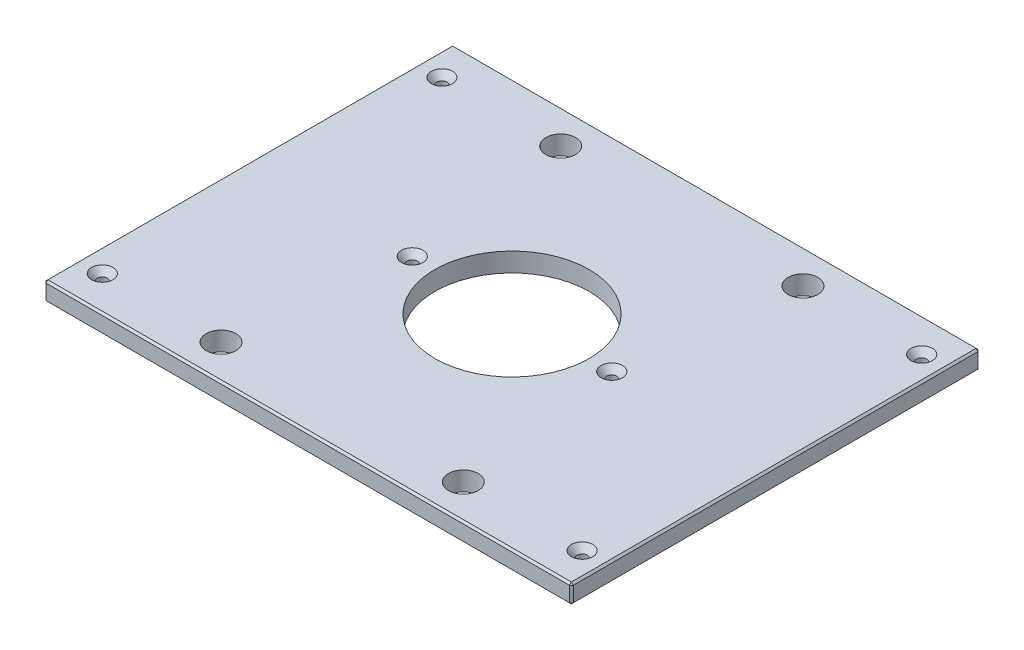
ISO-10303-21;
HEADER;
FILE_DESCRIPTION(('STEP AP214'),'2;1');
FILE_NAME('part.step','',(''),(''),'','','');
FILE_SCHEMA(('AUTOMOTIVE_DESIGN { 1 0 10303 214 1 1 1 1 }'));
ENDSEC;
DATA;
#1=APPLICATION_CONTEXT('core data for automotive mechanical design processes');
#2=APPLICATION_PROTOCOL_DEFINITION('international standard','automotive_design',2000,#1);
#3=PRODUCT_CONTEXT('',#1,'mechanical');
#4=PRODUCT('Part','Part','',(#3));
#5=PRODUCT_RELATED_PRODUCT_CATEGORY('part','',(#4));
#6=PRODUCT_DEFINITION_FORMATION('','',#4);
#7=PRODUCT_DEFINITION_CONTEXT('part definition',#1,'design');
#8=PRODUCT_DEFINITION('design','',#6,#7);
#9=PRODUCT_DEFINITION_SHAPE('','',#8);
#10=(LENGTH_UNIT() NAMED_UNIT(*) SI_UNIT(.MILLI.,.METRE.));
#11=(NAMED_UNIT(*) PLANE_ANGLE_UNIT() SI_UNIT($,.RADIAN.));
#12=(NAMED_UNIT(*) SI_UNIT($,.STERADIAN.) SOLID_ANGLE_UNIT());
#13=UNCERTAINTY_MEASURE_WITH_UNIT(LENGTH_MEASURE(1.E-05),#10,'distance_accuracy_value','');
#14=(GEOMETRIC_REPRESENTATION_CONTEXT(3) GLOBAL_UNCERTAINTY_ASSIGNED_CONTEXT((#13)) GLOBAL_UNIT_ASSIGNED_CONTEXT((#10,
#11,#12)) REPRESENTATION_CONTEXT('',''));
#15=CARTESIAN_POINT('',(0.,0.,0.));
#16=DIRECTION('',(0.,0.,1.));
#17=DIRECTION('',(1.,0.,0.));
#18=AXIS2_PLACEMENT_3D('',#15,#16,#17);
#19=CARTESIAN_POINT('',(-176.2125,12.7,-136.525));
#20=DIRECTION('',(1.,0.,0.));
#21=DIRECTION('',(0.,0.,-1.));
#22=AXIS2_PLACEMENT_3D('',#19,#20,#21);
#23=PLANE('',#22);
#24=DIRECTION('',(0.,0.,-1.));
#25=VECTOR('',#24,1.);
#26=CARTESIAN_POINT('',(-176.2125,11.4300000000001,-136.525));
#27=LINE('',#26,#25);
#28=CARTESIAN_POINT('',(-176.2125,11.4300000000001,135.255));
#29=VERTEX_POINT('',#28);
#30=CARTESIAN_POINT('',(-176.2125,11.4300000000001,-135.255));
#31=VERTEX_POINT('',#30);
#32=EDGE_CURVE('E135',#29,#31,#27,.T.);
#33=ORIENTED_EDGE('',*,*,#32,.T.);
#34=DIRECTION('',(0.,-1.,0.));
#35=VECTOR('',#34,1.);
#36=CARTESIAN_POINT('',(-176.2125,12.7,-135.255));
#37=LINE('',#36,#35);
#38=CARTESIAN_POINT('',(-176.2125,1.26999999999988,-135.255));
#39=VERTEX_POINT('',#38);
#40=EDGE_CURVE('E131',#31,#39,#37,.T.);
#41=ORIENTED_EDGE('',*,*,#40,.T.);
#42=DIRECTION('',(0.,0.,1.));
#43=VECTOR('',#42,1.);
#44=CARTESIAN_POINT('',(-176.2125,1.26999999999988,-136.525));
#45=LINE('',#44,#43);
#46=CARTESIAN_POINT('',(-176.2125,1.26999999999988,135.255));
#47=VERTEX_POINT('',#46);
#48=EDGE_CURVE('E126',#39,#47,#45,.T.);
#49=ORIENTED_EDGE('',*,*,#48,.T.);
#50=DIRECTION('',(0.,1.,0.));
#51=VECTOR('',#50,1.);
#52=CARTESIAN_POINT('',(-176.2125,12.7,135.255));
#53=LINE('',#52,#51);
#54=EDGE_CURVE('E128',#47,#29,#53,.T.);
#55=ORIENTED_EDGE('',*,*,#54,.T.);
#56=EDGE_LOOP('',(#33,#41,#49,#55));
#57=FACE_BOUND('',#56,.T.);
#58=ADVANCED_FACE('F35',(#57),#23,.F.);
#59=CARTESIAN_POINT('',(-176.2125,12.7,136.525));
#60=DIRECTION('',(0.,0.,-1.));
#61=DIRECTION('',(-1.,0.,0.));
#62=AXIS2_PLACEMENT_3D('',#59,#60,#61);
#63=PLANE('',#62);
#64=DIRECTION('',(1.,0.,0.));
#65=VECTOR('',#64,1.);
#66=CARTESIAN_POINT('',(-176.2125,1.26999999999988,136.525));
#67=LINE('',#66,#65);
#68=CARTESIAN_POINT('',(-174.9425,1.26999999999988,136.525));
#69=VERTEX_POINT('',#68);
#70=CARTESIAN_POINT('',(174.9425,1.26999999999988,136.525));
#71=VERTEX_POINT('',#70);
#72=EDGE_CURVE('E58',#69,#71,#67,.T.);
#73=ORIENTED_EDGE('',*,*,#72,.T.);
#74=DIRECTION('',(0.,1.,0.));
#75=VECTOR('',#74,1.);
#76=CARTESIAN_POINT('',(174.9425,12.7,136.525));
#77=LINE('',#76,#75);
#78=CARTESIAN_POINT('',(174.9425,11.4300000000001,136.525));
#79=VERTEX_POINT('',#78);
#80=EDGE_CURVE('E11',#71,#79,#77,.T.);
#81=ORIENTED_EDGE('',*,*,#80,.T.);
#82=DIRECTION('',(-1.,0.,0.));
#83=VECTOR('',#82,1.);
#84=CARTESIAN_POINT('',(-176.2125,11.4300000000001,136.525));
#85=LINE('',#84,#83);
#86=CARTESIAN_POINT('',(-174.9425,11.4300000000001,136.525));
#87=VERTEX_POINT('',#86);
#88=EDGE_CURVE('E44',#79,#87,#85,.T.);
#89=ORIENTED_EDGE('',*,*,#88,.T.);
#90=DIRECTION('',(0.,-1.,0.));
#91=VECTOR('',#90,1.);
#92=CARTESIAN_POINT('',(-174.9425,12.7,136.525));
#93=LINE('',#92,#91);
#94=EDGE_CURVE('E279',#87,#69,#93,.T.);
#95=ORIENTED_EDGE('',*,*,#94,.T.);
#96=EDGE_LOOP('',(#73,#81,#89,#95));
#97=FACE_BOUND('',#96,.T.);
#98=ADVANCED_FACE('F348',(#97),#63,.F.);
#99=CARTESIAN_POINT('',(176.2125,12.7,-136.525));
#100=DIRECTION('',(-1.,0.,0.));
#101=DIRECTION('',(0.,0.,1.));
#102=AXIS2_PLACEMENT_3D('',#99,#100,#101);
#103=PLANE('',#102);
#104=DIRECTION('',(0.,0.,-1.));
#105=VECTOR('',#104,1.);
#106=CARTESIAN_POINT('',(176.2125,1.26999999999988,-136.525));
#107=LINE('',#106,#105);
#108=CARTESIAN_POINT('',(176.2125,1.26999999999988,135.255));
#109=VERTEX_POINT('',#108);
#110=CARTESIAN_POINT('',(176.2125,1.26999999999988,-135.255));
#111=VERTEX_POINT('',#110);
#112=EDGE_CURVE('E274',#109,#111,#107,.T.);
#113=ORIENTED_EDGE('',*,*,#112,.T.);
#114=DIRECTION('',(0.,1.,0.));
#115=VECTOR('',#114,1.);
#116=CARTESIAN_POINT('',(176.2125,12.7,-135.255));
#117=LINE('',#116,#115);
#118=CARTESIAN_POINT('',(176.2125,11.4300000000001,-135.255));
#119=VERTEX_POINT('',#118);
#120=EDGE_CURVE('E276',#111,#119,#117,.T.);
#121=ORIENTED_EDGE('',*,*,#120,.T.);
#122=DIRECTION('',(0.,0.,1.));
#123=VECTOR('',#122,1.);
#124=CARTESIAN_POINT('',(176.2125,11.4300000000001,136.525));
#125=LINE('',#124,#123);
#126=CARTESIAN_POINT('',(176.2125,11.4300000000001,135.255));
#127=VERTEX_POINT('',#126);
#128=EDGE_CURVE('E272',#119,#127,#125,.T.);
#129=ORIENTED_EDGE('',*,*,#128,.T.);
#130=DIRECTION('',(0.,-1.,0.));
#131=VECTOR('',#130,1.);
#132=CARTESIAN_POINT('',(176.2125,12.7,135.255));
#133=LINE('',#132,#131);
#134=EDGE_CURVE('E270',#127,#109,#133,.T.);
#135=ORIENTED_EDGE('',*,*,#134,.T.);
#136=EDGE_LOOP('',(#113,#121,#129,#135));
#137=FACE_BOUND('',#136,.T.);
#138=ADVANCED_FACE('F335',(#137),#103,.F.);
#139=CARTESIAN_POINT('',(-176.2125,12.7,-136.525));
#140=DIRECTION('',(0.,0.,1.));
#141=DIRECTION('',(1.,0.,0.));
#142=AXIS2_PLACEMENT_3D('',#139,#140,#141);
#143=PLANE('',#142);
#144=DIRECTION('',(-1.,0.,0.));
#145=VECTOR('',#144,1.);
#146=CARTESIAN_POINT('',(-176.2125,1.26999999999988,-136.525));
#147=LINE('',#146,#145);
#148=CARTESIAN_POINT('',(174.9425,1.26999999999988,-136.525));
#149=VERTEX_POINT('',#148);
#150=CARTESIAN_POINT('',(-174.9425,1.26999999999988,-136.525));
#151=VERTEX_POINT('',#150);
#152=EDGE_CURVE('E246',#149,#151,#147,.T.);
#153=ORIENTED_EDGE('',*,*,#152,.T.);
#154=DIRECTION('',(0.,1.,0.));
#155=VECTOR('',#154,1.);
#156=CARTESIAN_POINT('',(-174.9425,12.7,-136.525));
#157=LINE('',#156,#155);
#158=CARTESIAN_POINT('',(-174.9425,11.4300000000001,-136.525));
#159=VERTEX_POINT('',#158);
#160=EDGE_CURVE('E250',#151,#159,#157,.T.);
#161=ORIENTED_EDGE('',*,*,#160,.T.);
#162=DIRECTION('',(1.,0.,0.));
#163=VECTOR('',#162,1.);
#164=CARTESIAN_POINT('',(176.2125,11.4300000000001,-136.525));
#165=LINE('',#164,#163);
#166=CARTESIAN_POINT('',(174.9425,11.4300000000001,-136.525));
#167=VERTEX_POINT('',#166);
#168=EDGE_CURVE('E248',#159,#167,#165,.T.);
#169=ORIENTED_EDGE('',*,*,#168,.T.);
#170=DIRECTION('',(0.,-1.,0.));
#171=VECTOR('',#170,1.);
#172=CARTESIAN_POINT('',(174.9425,12.7,-136.525));
#173=LINE('',#172,#171);
#174=EDGE_CURVE('E244',#167,#149,#173,.T.);
#175=ORIENTED_EDGE('',*,*,#174,.T.);
#176=EDGE_LOOP('',(#153,#161,#169,#175));
#177=FACE_BOUND('',#176,.T.);
#178=ADVANCED_FACE('F309',(#177),#143,.F.);
#179=CARTESIAN_POINT('',(0.,12.7,0.));
#180=DIRECTION('',(0.,1.,0.));
#181=DIRECTION('',(0.,0.,1.));
#182=AXIS2_PLACEMENT_3D('',#179,#180,#181);
#183=PLANE('',#182);
#184=CARTESIAN_POINT('',(160.3375,12.7,-113.50498));
#185=DIRECTION('',(0.,1.,0.));
#186=DIRECTION('',(0.,0.,1.));
#187=AXIS2_PLACEMENT_3D('',#184,#185,#186);
#188=CIRCLE('',#187,7.13739999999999);
#189=CARTESIAN_POINT('',(160.3375,12.7,-106.36758));
#190=VERTEX_POINT('',#189);
#191=EDGE_CURVE('E752',#190,#190,#188,.T.);
#192=ORIENTED_EDGE('',*,*,#191,.F.);
#193=EDGE_LOOP('',(#192));
#194=FACE_BOUND('',#193,.T.);
#195=CARTESIAN_POINT('',(160.3375,12.7,113.50498));
#196=DIRECTION('',(0.,1.,0.));
#197=DIRECTION('',(0.,0.,1.));
#198=AXIS2_PLACEMENT_3D('',#195,#196,#197);
#199=CIRCLE('',#198,7.13739999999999);
#200=CARTESIAN_POINT('',(160.3375,12.7,120.64238));
#201=VERTEX_POINT('',#200);
#202=EDGE_CURVE('E756',#201,#201,#199,.T.);
#203=ORIENTED_EDGE('',*,*,#202,.F.);
#204=EDGE_LOOP('',(#203));
#205=FACE_BOUND('',#204,.T.);
#206=CARTESIAN_POINT('',(-160.3375,12.7,113.50498));
#207=DIRECTION('',(0.,1.,0.));
#208=DIRECTION('',(0.,0.,1.));
#209=AXIS2_PLACEMENT_3D('',#206,#207,#208);
#210=CIRCLE('',#209,7.13739999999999);
#211=CARTESIAN_POINT('',(-160.3375,12.7,120.64238));
#212=VERTEX_POINT('',#211);
#213=EDGE_CURVE('E760',#212,#212,#210,.T.);
#214=ORIENTED_EDGE('',*,*,#213,.F.);
#215=EDGE_LOOP('',(#214));
#216=FACE_BOUND('',#215,.T.);
#217=CARTESIAN_POINT('',(-66.675,12.7,0.));
#218=DIRECTION('',(0.,1.,0.));
#219=DIRECTION('',(0.,0.,1.));
#220=AXIS2_PLACEMENT_3D('',#217,#218,#219);
#221=CIRCLE('',#220,7.1374);
#222=CARTESIAN_POINT('',(-66.675,12.7,7.1374));
#223=VERTEX_POINT('',#222);
#224=EDGE_CURVE('E764',#223,#223,#221,.T.);
#225=ORIENTED_EDGE('',*,*,#224,.F.);
#226=EDGE_LOOP('',(#225));
#227=FACE_BOUND('',#226,.T.);
#228=CARTESIAN_POINT('',(66.675,12.7,0.));
#229=DIRECTION('',(0.,1.,0.));
#230=DIRECTION('',(0.,0.,1.));
#231=AXIS2_PLACEMENT_3D('',#228,#229,#230);
#232=CIRCLE('',#231,7.1374);
#233=CARTESIAN_POINT('',(66.675,12.7,7.1374));
#234=VERTEX_POINT('',#233);
#235=EDGE_CURVE('E768',#234,#234,#232,.T.);
#236=ORIENTED_EDGE('',*,*,#235,.F.);
#237=EDGE_LOOP('',(#236));
#238=FACE_BOUND('',#237,.T.);
#239=CARTESIAN_POINT('',(-160.3375,12.7,-113.50498));
#240=DIRECTION('',(0.,1.,0.));
#241=DIRECTION('',(0.,0.,1.));
#242=AXIS2_PLACEMENT_3D('',#239,#240,#241);
#243=CIRCLE('',#242,7.13739999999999);
#244=CARTESIAN_POINT('',(-160.3375,12.7,-106.36758));
#245=VERTEX_POINT('',#244);
#246=EDGE_CURVE('E771',#245,#245,#243,.T.);
#247=ORIENTED_EDGE('',*,*,#246,.F.);
#248=EDGE_LOOP('',(#247));
#249=FACE_BOUND('',#248,.T.);
#250=DIRECTION('',(0.,0.,-1.));
#251=VECTOR('',#250,1.);
#252=CARTESIAN_POINT('',(174.9425,12.7,-136.525));
#253=LINE('',#252,#251);
#254=CARTESIAN_POINT('',(174.9425,12.7,135.255));
#255=VERTEX_POINT('',#254);
#256=CARTESIAN_POINT('',(174.9425,12.7,-135.255));
#257=VERTEX_POINT('',#256);
#258=EDGE_CURVE('E257',#255,#257,#253,.T.);
#259=ORIENTED_EDGE('',*,*,#258,.T.);
#260=DIRECTION('',(-1.,0.,0.));
#261=VECTOR('',#260,1.);
#262=CARTESIAN_POINT('',(-176.2125,12.7,-135.255));
#263=LINE('',#262,#261);
#264=CARTESIAN_POINT('',(-174.9425,12.7,-135.255));
#265=VERTEX_POINT('',#264);
#266=EDGE_CURVE('E259',#257,#265,#263,.T.);
#267=ORIENTED_EDGE('',*,*,#266,.T.);
#268=DIRECTION('',(0.,0.,1.));
#269=VECTOR('',#268,1.);
#270=CARTESIAN_POINT('',(-174.9425,12.7,136.525));
#271=LINE('',#270,#269);
#272=CARTESIAN_POINT('',(-174.9425,12.7,135.255));
#273=VERTEX_POINT('',#272);
#274=EDGE_CURVE('E255',#265,#273,#271,.T.);
#275=ORIENTED_EDGE('',*,*,#274,.T.);
#276=DIRECTION('',(1.,0.,0.));
#277=VECTOR('',#276,1.);
#278=CARTESIAN_POINT('',(176.2125,12.7,135.255));
#279=LINE('',#278,#277);
#280=EDGE_CURVE('E253',#273,#255,#279,.T.);
#281=ORIENTED_EDGE('',*,*,#280,.T.);
#282=EDGE_LOOP('',(#259,#267,#275,#281));
#283=FACE_BOUND('',#282,.T.);
#284=CARTESIAN_POINT('',(80.9625,12.7,-113.50498));
#285=DIRECTION('',(0.,1.,0.));
#286=DIRECTION('',(0.,0.,1.));
#287=AXIS2_PLACEMENT_3D('',#284,#285,#286);
#288=CIRCLE('',#287,9.921875);
#289=CARTESIAN_POINT('',(80.9625,12.7,-103.583105));
#290=VERTEX_POINT('',#289);
#291=EDGE_CURVE('E204',#290,#290,#288,.T.);
#292=ORIENTED_EDGE('',*,*,#291,.F.);
#293=EDGE_LOOP('',(#292));
#294=FACE_BOUND('',#293,.T.);
#295=CARTESIAN_POINT('',(-80.9625,12.7,-113.50498));
#296=DIRECTION('',(0.,1.,0.));
#297=DIRECTION('',(0.,0.,1.));
#298=AXIS2_PLACEMENT_3D('',#295,#296,#297);
#299=CIRCLE('',#298,9.921875);
#300=CARTESIAN_POINT('',(-80.9625,12.7,-103.583105));
#301=VERTEX_POINT('',#300);
#302=EDGE_CURVE('E214',#301,#301,#299,.T.);
#303=ORIENTED_EDGE('',*,*,#302,.F.);
#304=EDGE_LOOP('',(#303));
#305=FACE_BOUND('',#304,.T.);
#306=CARTESIAN_POINT('',(80.9625,12.7,113.50498));
#307=DIRECTION('',(0.,1.,0.));
#308=DIRECTION('',(0.,0.,1.));
#309=AXIS2_PLACEMENT_3D('',#306,#307,#308);
#310=CIRCLE('',#309,9.921875);
#311=CARTESIAN_POINT('',(80.9625,12.7,123.426855));
#312=VERTEX_POINT('',#311);
#313=EDGE_CURVE('E225',#312,#312,#310,.T.);
#314=ORIENTED_EDGE('',*,*,#313,.F.);
#315=EDGE_LOOP('',(#314));
#316=FACE_BOUND('',#315,.T.);
#317=CARTESIAN_POINT('',(-80.9625,12.7,113.50498));
#318=DIRECTION('',(0.,1.,0.));
#319=DIRECTION('',(0.,0.,1.));
#320=AXIS2_PLACEMENT_3D('',#317,#318,#319);
#321=CIRCLE('',#320,9.921875);
#322=CARTESIAN_POINT('',(-80.9625,12.7,123.426855));
#323=VERTEX_POINT('',#322);
#324=EDGE_CURVE('E231',#323,#323,#321,.T.);
#325=ORIENTED_EDGE('',*,*,#324,.F.);
#326=EDGE_LOOP('',(#325));
#327=FACE_BOUND('',#326,.T.);
#328=CARTESIAN_POINT('',(0.,12.7,0.));
#329=DIRECTION('',(0.,1.,0.));
#330=DIRECTION('',(0.,0.,1.));
#331=AXIS2_PLACEMENT_3D('',#328,#329,#330);
#332=CIRCLE('',#331,51.562);
#333=CARTESIAN_POINT('',(0.,12.7,51.562));
#334=VERTEX_POINT('',#333);
#335=EDGE_CURVE('E237',#334,#334,#332,.T.);
#336=ORIENTED_EDGE('',*,*,#335,.F.);
#337=EDGE_LOOP('',(#336));
#338=FACE_BOUND('',#337,.T.);
#339=ADVANCED_FACE('F357',(#194,#205,#216,#227,#238,#249,#283,#294,#305,#316,#327,#338),#183,.T.);
#340=CARTESIAN_POINT('',(0.,0.,0.));
#341=DIRECTION('',(0.,1.,0.));
#342=DIRECTION('',(0.,0.,1.));
#343=AXIS2_PLACEMENT_3D('',#340,#341,#342);
#344=PLANE('',#343);
#345=CARTESIAN_POINT('',(160.3375,0.,-113.50498));
#346=DIRECTION('',(0.,1.,0.));
#347=DIRECTION('',(0.,0.,1.));
#348=AXIS2_PLACEMENT_3D('',#345,#346,#347);
#349=CIRCLE('',#348,3.3782);
#350=CARTESIAN_POINT('',(160.3375,0.,-110.12678));
#351=VERTEX_POINT('',#350);
#352=EDGE_CURVE('E805',#351,#351,#349,.T.);
#353=ORIENTED_EDGE('',*,*,#352,.T.);
#354=EDGE_LOOP('',(#353));
#355=FACE_BOUND('',#354,.T.);
#356=CARTESIAN_POINT('',(160.3375,0.,113.50498));
#357=DIRECTION('',(0.,1.,0.));
#358=DIRECTION('',(0.,0.,1.));
#359=AXIS2_PLACEMENT_3D('',#356,#357,#358);
#360=CIRCLE('',#359,3.3782);
#361=CARTESIAN_POINT('',(160.3375,0.,116.88318));
#362=VERTEX_POINT('',#361);
#363=EDGE_CURVE('E798',#362,#362,#360,.T.);
#364=ORIENTED_EDGE('',*,*,#363,.T.);
#365=EDGE_LOOP('',(#364));
#366=FACE_BOUND('',#365,.T.);
#367=CARTESIAN_POINT('',(-160.3375,0.,113.50498));
#368=DIRECTION('',(0.,1.,0.));
#369=DIRECTION('',(0.,0.,1.));
#370=AXIS2_PLACEMENT_3D('',#367,#368,#369);
#371=CIRCLE('',#370,3.3782);
#372=CARTESIAN_POINT('',(-160.3375,0.,116.88318));
#373=VERTEX_POINT('',#372);
#374=EDGE_CURVE('E791',#373,#373,#371,.T.);
#375=ORIENTED_EDGE('',*,*,#374,.T.);
#376=EDGE_LOOP('',(#375));
#377=FACE_BOUND('',#376,.T.);
#378=CARTESIAN_POINT('',(-66.675,0.,0.));
#379=DIRECTION('',(0.,1.,0.));
#380=DIRECTION('',(0.,0.,1.));
#381=AXIS2_PLACEMENT_3D('',#378,#379,#380);
#382=CIRCLE('',#381,3.3782);
#383=CARTESIAN_POINT('',(-66.675,0.,3.3782));
#384=VERTEX_POINT('',#383);
#385=EDGE_CURVE('E784',#384,#384,#382,.T.);
#386=ORIENTED_EDGE('',*,*,#385,.T.);
#387=EDGE_LOOP('',(#386));
#388=FACE_BOUND('',#387,.T.);
#389=CARTESIAN_POINT('',(66.675,0.,0.));
#390=DIRECTION('',(0.,1.,0.));
#391=DIRECTION('',(0.,0.,1.));
#392=AXIS2_PLACEMENT_3D('',#389,#390,#391);
#393=CIRCLE('',#392,3.3782);
#394=CARTESIAN_POINT('',(66.675,0.,3.3782));
#395=VERTEX_POINT('',#394);
#396=EDGE_CURVE('E774',#395,#395,#393,.T.);
#397=ORIENTED_EDGE('',*,*,#396,.T.);
#398=EDGE_LOOP('',(#397));
#399=FACE_BOUND('',#398,.T.);
#400=CARTESIAN_POINT('',(-160.3375,0.,-113.50498));
#401=DIRECTION('',(0.,1.,0.));
#402=DIRECTION('',(0.,0.,1.));
#403=AXIS2_PLACEMENT_3D('',#400,#401,#402);
#404=CIRCLE('',#403,3.3782);
#405=CARTESIAN_POINT('',(-160.3375,0.,-110.12678));
#406=VERTEX_POINT('',#405);
#407=EDGE_CURVE('E217',#406,#406,#404,.T.);
#408=ORIENTED_EDGE('',*,*,#407,.T.);
#409=EDGE_LOOP('',(#408));
#410=FACE_BOUND('',#409,.T.);
#411=DIRECTION('',(0.,0.,-1.));
#412=VECTOR('',#411,1.);
#413=CARTESIAN_POINT('',(-174.9425,0.,0.));
#414=LINE('',#413,#412);
#415=CARTESIAN_POINT('',(-174.9425,0.,135.255));
#416=VERTEX_POINT('',#415);
#417=CARTESIAN_POINT('',(-174.9425,0.,-135.255));
#418=VERTEX_POINT('',#417);
#419=EDGE_CURVE('E158',#416,#418,#414,.T.);
#420=ORIENTED_EDGE('',*,*,#419,.T.);
#421=DIRECTION('',(1.,0.,0.));
#422=VECTOR('',#421,1.);
#423=CARTESIAN_POINT('',(0.,0.,-135.255));
#424=LINE('',#423,#422);
#425=CARTESIAN_POINT('',(174.9425,0.,-135.255));
#426=VERTEX_POINT('',#425);
#427=EDGE_CURVE('E267',#418,#426,#424,.T.);
#428=ORIENTED_EDGE('',*,*,#427,.T.);
#429=DIRECTION('',(0.,0.,1.));
#430=VECTOR('',#429,1.);
#431=CARTESIAN_POINT('',(174.9425,0.,0.));
#432=LINE('',#431,#430);
#433=CARTESIAN_POINT('',(174.9425,0.,135.255));
#434=VERTEX_POINT('',#433);
#435=EDGE_CURVE('E265',#426,#434,#432,.T.);
#436=ORIENTED_EDGE('',*,*,#435,.T.);
#437=DIRECTION('',(-1.,0.,0.));
#438=VECTOR('',#437,1.);
#439=CARTESIAN_POINT('',(0.,0.,135.255));
#440=LINE('',#439,#438);
#441=EDGE_CURVE('E262',#434,#416,#440,.T.);
#442=ORIENTED_EDGE('',*,*,#441,.T.);
#443=EDGE_LOOP('',(#420,#428,#436,#442));
#444=FACE_BOUND('',#443,.T.);
#445=CARTESIAN_POINT('',(80.9625,0.,-113.50498));
#446=DIRECTION('',(0.,1.,0.));
#447=DIRECTION('',(0.,0.,1.));
#448=AXIS2_PLACEMENT_3D('',#445,#446,#447);
#449=CIRCLE('',#448,9.921875);
#450=CARTESIAN_POINT('',(80.9625,0.,-103.583105));
#451=VERTEX_POINT('',#450);
#452=EDGE_CURVE('E209',#451,#451,#449,.T.);
#453=ORIENTED_EDGE('',*,*,#452,.T.);
#454=EDGE_LOOP('',(#453));
#455=FACE_BOUND('',#454,.T.);
#456=CARTESIAN_POINT('',(-80.9625,0.,-113.50498));
#457=DIRECTION('',(0.,1.,0.));
#458=DIRECTION('',(0.,0.,1.));
#459=AXIS2_PLACEMENT_3D('',#456,#457,#458);
#460=CIRCLE('',#459,9.921875);
#461=CARTESIAN_POINT('',(-80.9625,0.,-103.583105));
#462=VERTEX_POINT('',#461);
#463=EDGE_CURVE('E222',#462,#462,#460,.T.);
#464=ORIENTED_EDGE('',*,*,#463,.T.);
#465=EDGE_LOOP('',(#464));
#466=FACE_BOUND('',#465,.T.);
#467=CARTESIAN_POINT('',(80.9625,0.,113.50498));
#468=DIRECTION('',(0.,1.,0.));
#469=DIRECTION('',(0.,0.,1.));
#470=AXIS2_PLACEMENT_3D('',#467,#468,#469);
#471=CIRCLE('',#470,9.921875);
#472=CARTESIAN_POINT('',(80.9625,0.,123.426855));
#473=VERTEX_POINT('',#472);
#474=EDGE_CURVE('E228',#473,#473,#471,.T.);
#475=ORIENTED_EDGE('',*,*,#474,.T.);
#476=EDGE_LOOP('',(#475));
#477=FACE_BOUND('',#476,.T.);
#478=CARTESIAN_POINT('',(-80.9625,0.,113.50498));
#479=DIRECTION('',(0.,1.,0.));
#480=DIRECTION('',(0.,0.,1.));
#481=AXIS2_PLACEMENT_3D('',#478,#479,#480);
#482=CIRCLE('',#481,9.921875);
#483=CARTESIAN_POINT('',(-80.9625,0.,123.426855));
#484=VERTEX_POINT('',#483);
#485=EDGE_CURVE('E234',#484,#484,#482,.T.);
#486=ORIENTED_EDGE('',*,*,#485,.T.);
#487=EDGE_LOOP('',(#486));
#488=FACE_BOUND('',#487,.T.);
#489=CARTESIAN_POINT('',(0.,0.,0.));
#490=DIRECTION('',(0.,1.,0.));
#491=DIRECTION('',(0.,0.,1.));
#492=AXIS2_PLACEMENT_3D('',#489,#490,#491);
#493=CIRCLE('',#492,51.562);
#494=CARTESIAN_POINT('',(0.,0.,51.562));
#495=VERTEX_POINT('',#494);
#496=EDGE_CURVE('E147',#495,#495,#493,.T.);
#497=ORIENTED_EDGE('',*,*,#496,.T.);
#498=EDGE_LOOP('',(#497));
#499=FACE_BOUND('',#498,.T.);
#500=ADVANCED_FACE('F322',(#355,#366,#377,#388,#399,#410,#444,#455,#466,#477,#488,#499),#344,.F.);
#501=CARTESIAN_POINT('',(0.,0.,0.));
#502=DIRECTION('',(0.,1.,0.));
#503=DIRECTION('',(0.,0.,1.));
#504=AXIS2_PLACEMENT_3D('',#501,#502,#503);
#505=CYLINDRICAL_SURFACE('',#504,51.562);
#506=ORIENTED_EDGE('',*,*,#496,.F.);
#507=EDGE_LOOP('',(#506));
#508=FACE_BOUND('',#507,.T.);
#509=ORIENTED_EDGE('',*,*,#335,.T.);
#510=EDGE_LOOP('',(#509));
#511=FACE_BOUND('',#510,.T.);
#512=ADVANCED_FACE('F691',(#508,#511),#505,.F.);
#513=CARTESIAN_POINT('',(-80.9625,12.7,113.50498));
#514=DIRECTION('',(0.,1.,0.));
#515=DIRECTION('',(0.,0.,1.));
#516=AXIS2_PLACEMENT_3D('',#513,#514,#515);
#517=CYLINDRICAL_SURFACE('',#516,9.921875);
#518=ORIENTED_EDGE('',*,*,#485,.F.);
#519=EDGE_LOOP('',(#518));
#520=FACE_BOUND('',#519,.T.);
#521=ORIENTED_EDGE('',*,*,#324,.T.);
#522=EDGE_LOOP('',(#521));
#523=FACE_BOUND('',#522,.T.);
#524=ADVANCED_FACE('F682',(#520,#523),#517,.F.);
#525=CARTESIAN_POINT('',(80.9625,12.7,113.50498));
#526=DIRECTION('',(0.,1.,0.));
#527=DIRECTION('',(0.,0.,1.));
#528=AXIS2_PLACEMENT_3D('',#525,#526,#527);
#529=CYLINDRICAL_SURFACE('',#528,9.921875);
#530=ORIENTED_EDGE('',*,*,#474,.F.);
#531=EDGE_LOOP('',(#530));
#532=FACE_BOUND('',#531,.T.);
#533=ORIENTED_EDGE('',*,*,#313,.T.);
#534=EDGE_LOOP('',(#533));
#535=FACE_BOUND('',#534,.T.);
#536=ADVANCED_FACE('F673',(#532,#535),#529,.F.);
#537=CARTESIAN_POINT('',(-80.9625,12.7,-113.50498));
#538=DIRECTION('',(0.,1.,0.));
#539=DIRECTION('',(0.,0.,1.));
#540=AXIS2_PLACEMENT_3D('',#537,#538,#539);
#541=CYLINDRICAL_SURFACE('',#540,9.921875);
#542=ORIENTED_EDGE('',*,*,#463,.F.);
#543=EDGE_LOOP('',(#542));
#544=FACE_BOUND('',#543,.T.);
#545=ORIENTED_EDGE('',*,*,#302,.T.);
#546=EDGE_LOOP('',(#545));
#547=FACE_BOUND('',#546,.T.);
#548=ADVANCED_FACE('F663',(#544,#547),#541,.F.);
#549=CARTESIAN_POINT('',(80.9625,12.7,-113.50498));
#550=DIRECTION('',(0.,1.,0.));
#551=DIRECTION('',(0.,0.,1.));
#552=AXIS2_PLACEMENT_3D('',#549,#550,#551);
#553=CYLINDRICAL_SURFACE('',#552,9.921875);
#554=ORIENTED_EDGE('',*,*,#452,.F.);
#555=EDGE_LOOP('',(#554));
#556=FACE_BOUND('',#555,.T.);
#557=ORIENTED_EDGE('',*,*,#291,.T.);
#558=EDGE_LOOP('',(#557));
#559=FACE_BOUND('',#558,.T.);
#560=ADVANCED_FACE('F366',(#556,#559),#553,.F.);
#561=CARTESIAN_POINT('',(176.2125,12.7,135.255));
#562=DIRECTION('',(-0.707106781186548,0.,-0.707106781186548));
#563=DIRECTION('',(0.,-1.,0.));
#564=AXIS2_PLACEMENT_3D('',#561,#562,#563);
#565=PLANE('',#564);
#566=DIRECTION('',(-0.707106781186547,0.,0.707106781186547));
#567=VECTOR('',#566,1.);
#568=CARTESIAN_POINT('',(176.2125,11.4300000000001,135.255));
#569=LINE('',#568,#567);
#570=EDGE_CURVE('E39',#79,#127,#569,.F.);
#571=ORIENTED_EDGE('',*,*,#570,.F.);
#572=ORIENTED_EDGE('',*,*,#80,.F.);
#573=DIRECTION('',(0.707106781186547,0.,-0.707106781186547));
#574=VECTOR('',#573,1.);
#575=CARTESIAN_POINT('',(175.5775,1.26999999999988,135.89));
#576=LINE('',#575,#574);
#577=EDGE_CURVE('E197',#109,#71,#576,.F.);
#578=ORIENTED_EDGE('',*,*,#577,.F.);
#579=ORIENTED_EDGE('',*,*,#134,.F.);
#580=EDGE_LOOP('',(#571,#572,#578,#579));
#581=FACE_BOUND('',#580,.T.);
#582=ADVANCED_FACE('F37',(#581),#565,.F.);
#583=CARTESIAN_POINT('',(176.2125,11.4300000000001,135.255));
#584=DIRECTION('',(0.577350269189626,0.577350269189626,0.577350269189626));
#585=DIRECTION('',(0.707106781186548,0.,-0.707106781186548));
#586=AXIS2_PLACEMENT_3D('',#583,#584,#585);
#587=PLANE('',#586);
#588=DIRECTION('',(0.,-0.707106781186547,0.707106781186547));
#589=VECTOR('',#588,1.);
#590=CARTESIAN_POINT('',(174.9425,12.0650000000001,135.89));
#591=LINE('',#590,#589);
#592=EDGE_CURVE('E193',#79,#255,#591,.F.);
#593=ORIENTED_EDGE('',*,*,#592,.F.);
#594=ORIENTED_EDGE('',*,*,#570,.T.);
#595=DIRECTION('',(-0.707106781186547,0.707106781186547,0.));
#596=VECTOR('',#595,1.);
#597=CARTESIAN_POINT('',(176.2125,11.4300000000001,135.255));
#598=LINE('',#597,#596);
#599=EDGE_CURVE('E195',#255,#127,#598,.F.);
#600=ORIENTED_EDGE('',*,*,#599,.F.);
#601=EDGE_LOOP('',(#593,#594,#600));
#602=FACE_BOUND('',#601,.T.);
#603=ADVANCED_FACE('F359',(#602),#587,.T.);
#604=CARTESIAN_POINT('',(174.9425,0.,135.255));
#605=DIRECTION('',(0.577350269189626,-0.577350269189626,0.577350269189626));
#606=DIRECTION('',(0.707106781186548,0.,-0.707106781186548));
#607=AXIS2_PLACEMENT_3D('',#604,#605,#606);
#608=PLANE('',#607);
#609=DIRECTION('',(-0.707106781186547,-0.707106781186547,0.));
#610=VECTOR('',#609,1.);
#611=CARTESIAN_POINT('',(174.9425,0.,135.255));
#612=LINE('',#611,#610);
#613=EDGE_CURVE('E187',#109,#434,#612,.T.);
#614=ORIENTED_EDGE('',*,*,#613,.F.);
#615=ORIENTED_EDGE('',*,*,#577,.T.);
#616=DIRECTION('',(0.,0.707106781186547,0.707106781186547));
#617=VECTOR('',#616,1.);
#618=CARTESIAN_POINT('',(174.9425,0.,135.255));
#619=LINE('',#618,#617);
#620=EDGE_CURVE('E190',#434,#71,#619,.T.);
#621=ORIENTED_EDGE('',*,*,#620,.F.);
#622=EDGE_LOOP('',(#614,#615,#621));
#623=FACE_BOUND('',#622,.T.);
#624=ADVANCED_FACE('F328',(#623),#608,.T.);
#625=CARTESIAN_POINT('',(174.9425,12.7,0.));
#626=DIRECTION('',(0.707106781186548,0.707106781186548,0.));
#627=DIRECTION('',(0.,0.,1.));
#628=AXIS2_PLACEMENT_3D('',#625,#626,#627);
#629=PLANE('',#628);
#630=ORIENTED_EDGE('',*,*,#599,.T.);
#631=ORIENTED_EDGE('',*,*,#128,.F.);
#632=DIRECTION('',(0.707106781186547,-0.707106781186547,0.));
#633=VECTOR('',#632,1.);
#634=CARTESIAN_POINT('',(175.5775,12.0650000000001,-135.255));
#635=LINE('',#634,#633);
#636=EDGE_CURVE('E182',#257,#119,#635,.T.);
#637=ORIENTED_EDGE('',*,*,#636,.F.);
#638=ORIENTED_EDGE('',*,*,#258,.F.);
#639=EDGE_LOOP('',(#630,#631,#637,#638));
#640=FACE_BOUND('',#639,.T.);
#641=ADVANCED_FACE('F345',(#640),#629,.T.);
#642=CARTESIAN_POINT('',(0.,12.7,135.255));
#643=DIRECTION('',(0.,0.707106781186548,0.707106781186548));
#644=DIRECTION('',(-1.,0.,0.));
#645=AXIS2_PLACEMENT_3D('',#642,#643,#644);
#646=PLANE('',#645);
#647=ORIENTED_EDGE('',*,*,#592,.T.);
#648=ORIENTED_EDGE('',*,*,#280,.F.);
#649=DIRECTION('',(0.,0.707106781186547,-0.707106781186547));
#650=VECTOR('',#649,1.);
#651=CARTESIAN_POINT('',(-174.9425,12.7,135.255));
#652=LINE('',#651,#650);
#653=EDGE_CURVE('E179',#87,#273,#652,.T.);
#654=ORIENTED_EDGE('',*,*,#653,.F.);
#655=ORIENTED_EDGE('',*,*,#88,.F.);
#656=EDGE_LOOP('',(#647,#648,#654,#655));
#657=FACE_BOUND('',#656,.T.);
#658=ADVANCED_FACE('F350',(#657),#646,.T.);
#659=CARTESIAN_POINT('',(-174.9425,12.7,136.525));
#660=DIRECTION('',(0.707106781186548,0.,-0.707106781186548));
#661=DIRECTION('',(0.,-1.,0.));
#662=AXIS2_PLACEMENT_3D('',#659,#660,#661);
#663=PLANE('',#662);
#664=DIRECTION('',(0.707106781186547,0.,0.707106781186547));
#665=VECTOR('',#664,1.);
#666=CARTESIAN_POINT('',(-176.2125,1.26999999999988,135.255));
#667=LINE('',#666,#665);
#668=EDGE_CURVE('E142',#69,#47,#667,.F.);
#669=ORIENTED_EDGE('',*,*,#668,.F.);
#670=ORIENTED_EDGE('',*,*,#94,.F.);
#671=DIRECTION('',(-0.707106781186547,0.,-0.707106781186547));
#672=VECTOR('',#671,1.);
#673=CARTESIAN_POINT('',(-175.5775,11.4300000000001,135.89));
#674=LINE('',#673,#672);
#675=EDGE_CURVE('E145',#29,#87,#674,.F.);
#676=ORIENTED_EDGE('',*,*,#675,.F.);
#677=ORIENTED_EDGE('',*,*,#54,.F.);
#678=EDGE_LOOP('',(#669,#670,#676,#677));
#679=FACE_BOUND('',#678,.T.);
#680=ADVANCED_FACE('F140',(#679),#663,.F.);
#681=CARTESIAN_POINT('',(-176.2125,1.26999999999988,136.525));
#682=DIRECTION('',(0.,0.707106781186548,-0.707106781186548));
#683=DIRECTION('',(1.,0.,0.));
#684=AXIS2_PLACEMENT_3D('',#681,#682,#683);
#685=PLANE('',#684);
#686=ORIENTED_EDGE('',*,*,#620,.T.);
#687=ORIENTED_EDGE('',*,*,#72,.F.);
#688=DIRECTION('',(0.,-0.707106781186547,-0.707106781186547));
#689=VECTOR('',#688,1.);
#690=CARTESIAN_POINT('',(-174.9425,0.634999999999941,135.89));
#691=LINE('',#690,#689);
#692=EDGE_CURVE('E155',#416,#69,#691,.F.);
#693=ORIENTED_EDGE('',*,*,#692,.F.);
#694=ORIENTED_EDGE('',*,*,#441,.F.);
#695=EDGE_LOOP('',(#686,#687,#693,#694));
#696=FACE_BOUND('',#695,.T.);
#697=ADVANCED_FACE('F327',(#696),#685,.F.);
#698=CARTESIAN_POINT('',(176.2125,1.26999999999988,-136.525));
#699=DIRECTION('',(-0.707106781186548,0.707106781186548,0.));
#700=DIRECTION('',(0.,0.,-1.));
#701=AXIS2_PLACEMENT_3D('',#698,#699,#700);
#702=PLANE('',#701);
#703=ORIENTED_EDGE('',*,*,#613,.T.);
#704=ORIENTED_EDGE('',*,*,#435,.F.);
#705=DIRECTION('',(0.707106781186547,0.707106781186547,0.));
#706=VECTOR('',#705,1.);
#707=CARTESIAN_POINT('',(174.9425,0.,-135.255));
#708=LINE('',#707,#706);
#709=EDGE_CURVE('E174',#111,#426,#708,.F.);
#710=ORIENTED_EDGE('',*,*,#709,.F.);
#711=ORIENTED_EDGE('',*,*,#112,.F.);
#712=EDGE_LOOP('',(#703,#704,#710,#711));
#713=FACE_BOUND('',#712,.T.);
#714=ADVANCED_FACE('F332',(#713),#702,.F.);
#715=CARTESIAN_POINT('',(174.9425,12.7,-136.525));
#716=DIRECTION('',(-0.707106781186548,0.,0.707106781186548));
#717=DIRECTION('',(0.,-1.,0.));
#718=AXIS2_PLACEMENT_3D('',#715,#716,#717);
#719=PLANE('',#718);
#720=DIRECTION('',(0.707106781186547,0.,0.707106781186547));
#721=VECTOR('',#720,1.);
#722=CARTESIAN_POINT('',(174.9425,11.4300000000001,-136.525));
#723=LINE('',#722,#721);
#724=EDGE_CURVE('E184',#119,#167,#723,.F.);
#725=ORIENTED_EDGE('',*,*,#724,.F.);
#726=ORIENTED_EDGE('',*,*,#120,.F.);
#727=DIRECTION('',(-0.707106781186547,0.,-0.707106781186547));
#728=VECTOR('',#727,1.);
#729=CARTESIAN_POINT('',(175.5775,1.26999999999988,-135.89));
#730=LINE('',#729,#728);
#731=EDGE_CURVE('E171',#149,#111,#730,.F.);
#732=ORIENTED_EDGE('',*,*,#731,.F.);
#733=ORIENTED_EDGE('',*,*,#174,.F.);
#734=EDGE_LOOP('',(#725,#726,#732,#733));
#735=FACE_BOUND('',#734,.T.);
#736=ADVANCED_FACE('F340',(#735),#719,.F.);
#737=CARTESIAN_POINT('',(174.9425,11.4300000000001,-136.525));
#738=DIRECTION('',(0.577350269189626,0.577350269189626,-0.577350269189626));
#739=DIRECTION('',(-0.707106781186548,0.,-0.707106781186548));
#740=AXIS2_PLACEMENT_3D('',#737,#738,#739);
#741=PLANE('',#740);
#742=ORIENTED_EDGE('',*,*,#636,.T.);
#743=ORIENTED_EDGE('',*,*,#724,.T.);
#744=DIRECTION('',(0.,0.707106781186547,0.707106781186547));
#745=VECTOR('',#744,1.);
#746=CARTESIAN_POINT('',(174.9425,11.4300000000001,-136.525));
#747=LINE('',#746,#745);
#748=EDGE_CURVE('E163',#257,#167,#747,.F.);
#749=ORIENTED_EDGE('',*,*,#748,.F.);
#750=EDGE_LOOP('',(#742,#743,#749));
#751=FACE_BOUND('',#750,.T.);
#752=ADVANCED_FACE('F398',(#751),#741,.T.);
#753=CARTESIAN_POINT('',(-174.9425,12.7,135.255));
#754=DIRECTION('',(-0.577350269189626,0.577350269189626,0.577350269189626));
#755=DIRECTION('',(0.707106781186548,0.,0.707106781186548));
#756=AXIS2_PLACEMENT_3D('',#753,#754,#755);
#757=PLANE('',#756);
#758=ORIENTED_EDGE('',*,*,#675,.T.);
#759=ORIENTED_EDGE('',*,*,#653,.T.);
#760=DIRECTION('',(-0.707106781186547,-0.707106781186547,0.));
#761=VECTOR('',#760,1.);
#762=CARTESIAN_POINT('',(-174.9425,12.7,135.255));
#763=LINE('',#762,#761);
#764=EDGE_CURVE('E159',#29,#273,#763,.F.);
#765=ORIENTED_EDGE('',*,*,#764,.F.);
#766=EDGE_LOOP('',(#758,#759,#765));
#767=FACE_BOUND('',#766,.T.);
#768=ADVANCED_FACE('F352',(#767),#757,.T.);
#769=CARTESIAN_POINT('',(-176.2125,1.26999999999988,135.255));
#770=DIRECTION('',(-0.577350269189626,-0.577350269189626,0.577350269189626));
#771=DIRECTION('',(0.707106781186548,0.,0.707106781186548));
#772=AXIS2_PLACEMENT_3D('',#769,#770,#771);
#773=PLANE('',#772);
#774=ORIENTED_EDGE('',*,*,#692,.T.);
#775=ORIENTED_EDGE('',*,*,#668,.T.);
#776=DIRECTION('',(-0.707106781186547,0.707106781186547,0.));
#777=VECTOR('',#776,1.);
#778=CARTESIAN_POINT('',(-176.2125,1.26999999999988,135.255));
#779=LINE('',#778,#777);
#780=EDGE_CURVE('E152',#416,#47,#779,.T.);
#781=ORIENTED_EDGE('',*,*,#780,.F.);
#782=EDGE_LOOP('',(#774,#775,#781));
#783=FACE_BOUND('',#782,.T.);
#784=ADVANCED_FACE('F151',(#783),#773,.T.);
#785=CARTESIAN_POINT('',(174.9425,0.,-135.255));
#786=DIRECTION('',(0.577350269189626,-0.577350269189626,-0.577350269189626));
#787=DIRECTION('',(-0.707106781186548,0.,-0.707106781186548));
#788=AXIS2_PLACEMENT_3D('',#785,#786,#787);
#789=PLANE('',#788);
#790=ORIENTED_EDGE('',*,*,#731,.T.);
#791=ORIENTED_EDGE('',*,*,#709,.T.);
#792=DIRECTION('',(0.,-0.707106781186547,0.707106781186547));
#793=VECTOR('',#792,1.);
#794=CARTESIAN_POINT('',(174.9425,0.,-135.255));
#795=LINE('',#794,#793);
#796=EDGE_CURVE('E160',#149,#426,#795,.T.);
#797=ORIENTED_EDGE('',*,*,#796,.F.);
#798=EDGE_LOOP('',(#790,#791,#797));
#799=FACE_BOUND('',#798,.T.);
#800=ADVANCED_FACE('F390',(#799),#789,.T.);
#801=CARTESIAN_POINT('',(0.,12.7,-135.255));
#802=DIRECTION('',(0.,0.707106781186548,-0.707106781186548));
#803=DIRECTION('',(1.,0.,0.));
#804=AXIS2_PLACEMENT_3D('',#801,#802,#803);
#805=PLANE('',#804);
#806=ORIENTED_EDGE('',*,*,#748,.T.);
#807=ORIENTED_EDGE('',*,*,#168,.F.);
#808=DIRECTION('',(0.,-0.707106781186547,-0.707106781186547));
#809=VECTOR('',#808,1.);
#810=CARTESIAN_POINT('',(-174.9425,11.4300000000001,-136.525));
#811=LINE('',#810,#809);
#812=EDGE_CURVE('E165',#265,#159,#811,.T.);
#813=ORIENTED_EDGE('',*,*,#812,.F.);
#814=ORIENTED_EDGE('',*,*,#266,.F.);
#815=EDGE_LOOP('',(#806,#807,#813,#814));
#816=FACE_BOUND('',#815,.T.);
#817=ADVANCED_FACE('F304',(#816),#805,.T.);
#818=CARTESIAN_POINT('',(-174.9425,12.7,0.));
#819=DIRECTION('',(-0.707106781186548,0.707106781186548,0.));
#820=DIRECTION('',(0.,0.,-1.));
#821=AXIS2_PLACEMENT_3D('',#818,#819,#820);
#822=PLANE('',#821);
#823=ORIENTED_EDGE('',*,*,#764,.T.);
#824=ORIENTED_EDGE('',*,*,#274,.F.);
#825=DIRECTION('',(0.707106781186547,0.707106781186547,0.));
#826=VECTOR('',#825,1.);
#827=CARTESIAN_POINT('',(-175.5775,12.0650000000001,-135.255));
#828=LINE('',#827,#826);
#829=EDGE_CURVE('E293',#31,#265,#828,.T.);
#830=ORIENTED_EDGE('',*,*,#829,.F.);
#831=ORIENTED_EDGE('',*,*,#32,.F.);
#832=EDGE_LOOP('',(#823,#824,#830,#831));
#833=FACE_BOUND('',#832,.T.);
#834=ADVANCED_FACE('F355',(#833),#822,.T.);
#835=CARTESIAN_POINT('',(-176.2125,1.26999999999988,-136.525));
#836=DIRECTION('',(0.707106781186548,0.707106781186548,0.));
#837=DIRECTION('',(0.,0.,1.));
#838=AXIS2_PLACEMENT_3D('',#835,#836,#837);
#839=PLANE('',#838);
#840=ORIENTED_EDGE('',*,*,#780,.T.);
#841=ORIENTED_EDGE('',*,*,#48,.F.);
#842=DIRECTION('',(0.707106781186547,-0.707106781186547,0.));
#843=VECTOR('',#842,1.);
#844=CARTESIAN_POINT('',(-176.2125,1.26999999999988,-135.255));
#845=LINE('',#844,#843);
#846=EDGE_CURVE('E290',#418,#39,#845,.F.);
#847=ORIENTED_EDGE('',*,*,#846,.F.);
#848=ORIENTED_EDGE('',*,*,#419,.F.);
#849=EDGE_LOOP('',(#840,#841,#847,#848));
#850=FACE_BOUND('',#849,.T.);
#851=ADVANCED_FACE('F157',(#850),#839,.F.);
#852=CARTESIAN_POINT('',(-176.2125,1.26999999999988,-136.525));
#853=DIRECTION('',(0.,0.707106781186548,0.707106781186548));
#854=DIRECTION('',(-1.,0.,0.));
#855=AXIS2_PLACEMENT_3D('',#852,#853,#854);
#856=PLANE('',#855);
#857=ORIENTED_EDGE('',*,*,#796,.T.);
#858=ORIENTED_EDGE('',*,*,#427,.F.);
#859=DIRECTION('',(0.,0.707106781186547,-0.707106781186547));
#860=VECTOR('',#859,1.);
#861=CARTESIAN_POINT('',(-174.9425,0.634999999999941,-135.89));
#862=LINE('',#861,#860);
#863=EDGE_CURVE('E287',#151,#418,#862,.F.);
#864=ORIENTED_EDGE('',*,*,#863,.F.);
#865=ORIENTED_EDGE('',*,*,#152,.F.);
#866=EDGE_LOOP('',(#857,#858,#864,#865));
#867=FACE_BOUND('',#866,.T.);
#868=ADVANCED_FACE('F319',(#867),#856,.F.);
#869=CARTESIAN_POINT('',(-174.9425,11.4300000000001,-136.525));
#870=DIRECTION('',(-0.577350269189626,0.577350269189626,-0.577350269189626));
#871=DIRECTION('',(-0.707106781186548,0.,0.707106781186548));
#872=AXIS2_PLACEMENT_3D('',#869,#870,#871);
#873=PLANE('',#872);
#874=ORIENTED_EDGE('',*,*,#829,.T.);
#875=ORIENTED_EDGE('',*,*,#812,.T.);
#876=DIRECTION('',(0.707106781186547,0.,-0.707106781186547));
#877=VECTOR('',#876,1.);
#878=CARTESIAN_POINT('',(-174.9425,11.4300000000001,-136.525));
#879=LINE('',#878,#877);
#880=EDGE_CURVE('E285',#31,#159,#879,.T.);
#881=ORIENTED_EDGE('',*,*,#880,.F.);
#882=EDGE_LOOP('',(#874,#875,#881));
#883=FACE_BOUND('',#882,.T.);
#884=ADVANCED_FACE('F299',(#883),#873,.T.);
#885=CARTESIAN_POINT('',(-176.2125,1.26999999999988,-135.255));
#886=DIRECTION('',(-0.577350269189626,-0.577350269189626,-0.577350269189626));
#887=DIRECTION('',(-0.707106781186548,0.,0.707106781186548));
#888=AXIS2_PLACEMENT_3D('',#885,#886,#887);
#889=PLANE('',#888);
#890=ORIENTED_EDGE('',*,*,#863,.T.);
#891=ORIENTED_EDGE('',*,*,#846,.T.);
#892=DIRECTION('',(-0.707106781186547,0.,0.707106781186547));
#893=VECTOR('',#892,1.);
#894=CARTESIAN_POINT('',(-176.2125,1.26999999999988,-135.255));
#895=LINE('',#894,#893);
#896=EDGE_CURVE('E283',#151,#39,#895,.T.);
#897=ORIENTED_EDGE('',*,*,#896,.F.);
#898=EDGE_LOOP('',(#890,#891,#897));
#899=FACE_BOUND('',#898,.T.);
#900=ADVANCED_FACE('F316',(#899),#889,.T.);
#901=CARTESIAN_POINT('',(-176.2125,12.7,-135.255));
#902=DIRECTION('',(0.707106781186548,0.,0.707106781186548));
#903=DIRECTION('',(0.,-1.,0.));
#904=AXIS2_PLACEMENT_3D('',#901,#902,#903);
#905=PLANE('',#904);
#906=ORIENTED_EDGE('',*,*,#880,.T.);
#907=ORIENTED_EDGE('',*,*,#160,.F.);
#908=ORIENTED_EDGE('',*,*,#896,.T.);
#909=ORIENTED_EDGE('',*,*,#40,.F.);
#910=EDGE_LOOP('',(#906,#907,#908,#909));
#911=FACE_BOUND('',#910,.T.);
#912=ADVANCED_FACE('F314',(#911),#905,.F.);
#913=CARTESIAN_POINT('',(-160.3375,12.7,-113.50498));
#914=DIRECTION('',(0.,1.,0.));
#915=DIRECTION('',(0.,0.,1.));
#916=AXIS2_PLACEMENT_3D('',#913,#914,#915);
#917=CYLINDRICAL_SURFACE('',#916,3.3782);
#918=ORIENTED_EDGE('',*,*,#407,.F.);
#919=EDGE_LOOP('',(#918));
#920=FACE_BOUND('',#919,.T.);
#921=CARTESIAN_POINT('',(-160.3375,8.37553508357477,-113.50498));
#922=DIRECTION('',(0.,1.,0.));
#923=DIRECTION('',(0.,0.,1.));
#924=AXIS2_PLACEMENT_3D('',#921,#922,#923);
#925=CIRCLE('',#924,3.3782);
#926=CARTESIAN_POINT('',(-160.3375,8.37553508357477,-110.12678));
#927=VERTEX_POINT('',#926);
#928=EDGE_CURVE('E773',#927,#927,#925,.T.);
#929=ORIENTED_EDGE('',*,*,#928,.T.);
#930=EDGE_LOOP('',(#929));
#931=FACE_BOUND('',#930,.T.);
#932=ADVANCED_FACE('F377',(#920,#931),#917,.F.);
#933=CARTESIAN_POINT('',(-160.3375,12.7,-113.50498));
#934=DIRECTION('',(0.,1.,0.));
#935=DIRECTION('',(0.,0.,1.));
#936=AXIS2_PLACEMENT_3D('',#933,#934,#935);
#937=CONICAL_SURFACE('',#936,7.13739999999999,0.715584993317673);
#938=ORIENTED_EDGE('',*,*,#928,.F.);
#939=EDGE_LOOP('',(#938));
#940=FACE_BOUND('',#939,.T.);
#941=ORIENTED_EDGE('',*,*,#246,.T.);
#942=EDGE_LOOP('',(#941));
#943=FACE_BOUND('',#942,.T.);
#944=ADVANCED_FACE('F487',(#940,#943),#937,.F.);
#945=CARTESIAN_POINT('',(66.675,12.7,0.));
#946=DIRECTION('',(0.,1.,0.));
#947=DIRECTION('',(0.,0.,1.));
#948=AXIS2_PLACEMENT_3D('',#945,#946,#947);
#949=CYLINDRICAL_SURFACE('',#948,3.3782);
#950=ORIENTED_EDGE('',*,*,#396,.F.);
#951=EDGE_LOOP('',(#950));
#952=FACE_BOUND('',#951,.T.);
#953=CARTESIAN_POINT('',(66.675,8.37553508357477,0.));
#954=DIRECTION('',(0.,1.,0.));
#955=DIRECTION('',(0.,0.,1.));
#956=AXIS2_PLACEMENT_3D('',#953,#954,#955);
#957=CIRCLE('',#956,3.3782);
#958=CARTESIAN_POINT('',(66.675,8.37553508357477,3.3782));
#959=VERTEX_POINT('',#958);
#960=EDGE_CURVE('E778',#959,#959,#957,.T.);
#961=ORIENTED_EDGE('',*,*,#960,.T.);
#962=EDGE_LOOP('',(#961));
#963=FACE_BOUND('',#962,.T.);
#964=ADVANCED_FACE('F496',(#952,#963),#949,.F.);
#965=CARTESIAN_POINT('',(66.675,12.7,0.));
#966=DIRECTION('',(0.,1.,0.));
#967=DIRECTION('',(0.,0.,1.));
#968=AXIS2_PLACEMENT_3D('',#965,#966,#967);
#969=CONICAL_SURFACE('',#968,7.1374,0.715584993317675);
#970=ORIENTED_EDGE('',*,*,#960,.F.);
#971=EDGE_LOOP('',(#970));
#972=FACE_BOUND('',#971,.T.);
#973=ORIENTED_EDGE('',*,*,#235,.T.);
#974=EDGE_LOOP('',(#973));
#975=FACE_BOUND('',#974,.T.);
#976=ADVANCED_FACE('F504',(#972,#975),#969,.F.);
#977=CARTESIAN_POINT('',(-66.675,12.7,0.));
#978=DIRECTION('',(0.,1.,0.));
#979=DIRECTION('',(0.,0.,1.));
#980=AXIS2_PLACEMENT_3D('',#977,#978,#979);
#981=CYLINDRICAL_SURFACE('',#980,3.3782);
#982=ORIENTED_EDGE('',*,*,#385,.F.);
#983=EDGE_LOOP('',(#982));
#984=FACE_BOUND('',#983,.T.);
#985=CARTESIAN_POINT('',(-66.675,8.37553508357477,0.));
#986=DIRECTION('',(0.,1.,0.));
#987=DIRECTION('',(0.,0.,1.));
#988=AXIS2_PLACEMENT_3D('',#985,#986,#987);
#989=CIRCLE('',#988,3.3782);
#990=CARTESIAN_POINT('',(-66.675,8.37553508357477,3.3782));
#991=VERTEX_POINT('',#990);
#992=EDGE_CURVE('E787',#991,#991,#989,.T.);
#993=ORIENTED_EDGE('',*,*,#992,.T.);
#994=EDGE_LOOP('',(#993));
#995=FACE_BOUND('',#994,.T.);
#996=ADVANCED_FACE('F512',(#984,#995),#981,.F.);
#997=CARTESIAN_POINT('',(-66.675,12.7,0.));
#998=DIRECTION('',(0.,1.,0.));
#999=DIRECTION('',(0.,0.,1.));
#1000=AXIS2_PLACEMENT_3D('',#997,#998,#999);
#1001=CONICAL_SURFACE('',#1000,7.1374,0.715584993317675);
#1002=ORIENTED_EDGE('',*,*,#992,.F.);
#1003=EDGE_LOOP('',(#1002));
#1004=FACE_BOUND('',#1003,.T.);
#1005=ORIENTED_EDGE('',*,*,#224,.T.);
#1006=EDGE_LOOP('',(#1005));
#1007=FACE_BOUND('',#1006,.T.);
#1008=ADVANCED_FACE('F520',(#1004,#1007),#1001,.F.);
#1009=CARTESIAN_POINT('',(-160.3375,12.7,113.50498));
#1010=DIRECTION('',(0.,1.,0.));
#1011=DIRECTION('',(0.,0.,1.));
#1012=AXIS2_PLACEMENT_3D('',#1009,#1010,#1011);
#1013=CYLINDRICAL_SURFACE('',#1012,3.3782);
#1014=ORIENTED_EDGE('',*,*,#374,.F.);
#1015=EDGE_LOOP('',(#1014));
#1016=FACE_BOUND('',#1015,.T.);
#1017=CARTESIAN_POINT('',(-160.3375,8.37553508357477,113.50498));
#1018=DIRECTION('',(0.,1.,0.));
#1019=DIRECTION('',(0.,0.,1.));
#1020=AXIS2_PLACEMENT_3D('',#1017,#1018,#1019);
#1021=CIRCLE('',#1020,3.3782);
#1022=CARTESIAN_POINT('',(-160.3375,8.37553508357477,116.88318));
#1023=VERTEX_POINT('',#1022);
#1024=EDGE_CURVE('E794',#1023,#1023,#1021,.T.);
#1025=ORIENTED_EDGE('',*,*,#1024,.T.);
#1026=EDGE_LOOP('',(#1025));
#1027=FACE_BOUND('',#1026,.T.);
#1028=ADVANCED_FACE('F528',(#1016,#1027),#1013,.F.);
#1029=CARTESIAN_POINT('',(-160.3375,12.7,113.50498));
#1030=DIRECTION('',(0.,1.,0.));
#1031=DIRECTION('',(0.,0.,1.));
#1032=AXIS2_PLACEMENT_3D('',#1029,#1030,#1031);
#1033=CONICAL_SURFACE('',#1032,7.13739999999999,0.715584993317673);
#1034=ORIENTED_EDGE('',*,*,#1024,.F.);
#1035=EDGE_LOOP('',(#1034));
#1036=FACE_BOUND('',#1035,.T.);
#1037=ORIENTED_EDGE('',*,*,#213,.T.);
#1038=EDGE_LOOP('',(#1037));
#1039=FACE_BOUND('',#1038,.T.);
#1040=ADVANCED_FACE('F536',(#1036,#1039),#1033,.F.);
#1041=CARTESIAN_POINT('',(160.3375,12.7,113.50498));
#1042=DIRECTION('',(0.,1.,0.));
#1043=DIRECTION('',(0.,0.,1.));
#1044=AXIS2_PLACEMENT_3D('',#1041,#1042,#1043);
#1045=CYLINDRICAL_SURFACE('',#1044,3.3782);
#1046=ORIENTED_EDGE('',*,*,#363,.F.);
#1047=EDGE_LOOP('',(#1046));
#1048=FACE_BOUND('',#1047,.T.);
#1049=CARTESIAN_POINT('',(160.3375,8.37553508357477,113.50498));
#1050=DIRECTION('',(0.,1.,0.));
#1051=DIRECTION('',(0.,0.,1.));
#1052=AXIS2_PLACEMENT_3D('',#1049,#1050,#1051);
#1053=CIRCLE('',#1052,3.3782);
#1054=CARTESIAN_POINT('',(160.3375,8.37553508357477,116.88318));
#1055=VERTEX_POINT('',#1054);
#1056=EDGE_CURVE('E801',#1055,#1055,#1053,.T.);
#1057=ORIENTED_EDGE('',*,*,#1056,.T.);
#1058=EDGE_LOOP('',(#1057));
#1059=FACE_BOUND('',#1058,.T.);
#1060=ADVANCED_FACE('F544',(#1048,#1059),#1045,.F.);
#1061=CARTESIAN_POINT('',(160.3375,12.7,113.50498));
#1062=DIRECTION('',(0.,1.,0.));
#1063=DIRECTION('',(0.,0.,1.));
#1064=AXIS2_PLACEMENT_3D('',#1061,#1062,#1063);
#1065=CONICAL_SURFACE('',#1064,7.13739999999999,0.715584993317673);
#1066=ORIENTED_EDGE('',*,*,#1056,.F.);
#1067=EDGE_LOOP('',(#1066));
#1068=FACE_BOUND('',#1067,.T.);
#1069=ORIENTED_EDGE('',*,*,#202,.T.);
#1070=EDGE_LOOP('',(#1069));
#1071=FACE_BOUND('',#1070,.T.);
#1072=ADVANCED_FACE('F552',(#1068,#1071),#1065,.F.);
#1073=CARTESIAN_POINT('',(160.3375,12.7,-113.50498));
#1074=DIRECTION('',(0.,1.,0.));
#1075=DIRECTION('',(0.,0.,1.));
#1076=AXIS2_PLACEMENT_3D('',#1073,#1074,#1075);
#1077=CYLINDRICAL_SURFACE('',#1076,3.3782);
#1078=ORIENTED_EDGE('',*,*,#352,.F.);
#1079=EDGE_LOOP('',(#1078));
#1080=FACE_BOUND('',#1079,.T.);
#1081=CARTESIAN_POINT('',(160.3375,8.37553508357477,-113.50498));
#1082=DIRECTION('',(0.,1.,0.));
#1083=DIRECTION('',(0.,0.,1.));
#1084=AXIS2_PLACEMENT_3D('',#1081,#1082,#1083);
#1085=CIRCLE('',#1084,3.3782);
#1086=CARTESIAN_POINT('',(160.3375,8.37553508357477,-110.12678));
#1087=VERTEX_POINT('',#1086);
#1088=EDGE_CURVE('E808',#1087,#1087,#1085,.T.);
#1089=ORIENTED_EDGE('',*,*,#1088,.T.);
#1090=EDGE_LOOP('',(#1089));
#1091=FACE_BOUND('',#1090,.T.);
#1092=ADVANCED_FACE('F560',(#1080,#1091),#1077,.F.);
#1093=CARTESIAN_POINT('',(160.3375,12.7,-113.50498));
#1094=DIRECTION('',(0.,1.,0.));
#1095=DIRECTION('',(0.,0.,1.));
#1096=AXIS2_PLACEMENT_3D('',#1093,#1094,#1095);
#1097=CONICAL_SURFACE('',#1096,7.13739999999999,0.715584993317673);
#1098=ORIENTED_EDGE('',*,*,#1088,.F.);
#1099=EDGE_LOOP('',(#1098));
#1100=FACE_BOUND('',#1099,.T.);
#1101=ORIENTED_EDGE('',*,*,#191,.T.);
#1102=EDGE_LOOP('',(#1101));
#1103=FACE_BOUND('',#1102,.T.);
#1104=ADVANCED_FACE('F568',(#1100,#1103),#1097,.F.);
#1105=CLOSED_SHELL('',(#58,#98,#138,#178,#339,#500,#512,#524,#536,#548,#560,#582,#603,#624,#641,
#658,#680,#697,#714,#736,#752,#768,#784,#800,#817,#834,#851,#868,#884,#900,#912,#932,#944,#964,
#976,#996,#1008,#1028,#1040,#1060,#1072,#1092,#1104));
#1106=MANIFOLD_SOLID_BREP('B2',#1105);
#1107=ADVANCED_BREP_SHAPE_REPRESENTATION('',(#18,#1106),#14);
#1108=SHAPE_DEFINITION_REPRESENTATION(#9,#1107);
ENDSEC;
END-ISO-10303-21;
